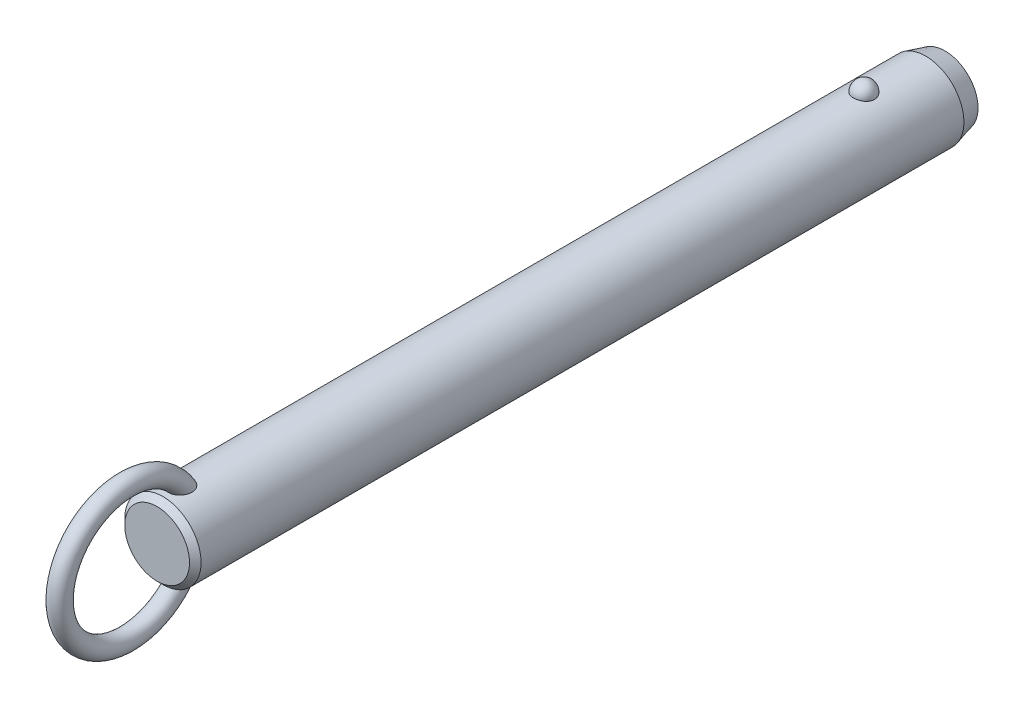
ISO-10303-21;
HEADER;
FILE_DESCRIPTION(('STEP AP214'),'2;1');
FILE_NAME('part.step','',(''),(''),'','','');
FILE_SCHEMA(('AUTOMOTIVE_DESIGN { 1 0 10303 214 1 1 1 1 }'));
ENDSEC;
DATA;
#1=APPLICATION_CONTEXT('core data for automotive mechanical design processes');
#2=APPLICATION_PROTOCOL_DEFINITION('international standard','automotive_design',2000,#1);
#3=PRODUCT_CONTEXT('',#1,'mechanical');
#4=PRODUCT('Part','Part','',(#3));
#5=PRODUCT_RELATED_PRODUCT_CATEGORY('part','',(#4));
#6=PRODUCT_DEFINITION_FORMATION('','',#4);
#7=PRODUCT_DEFINITION_CONTEXT('part definition',#1,'design');
#8=PRODUCT_DEFINITION('design','',#6,#7);
#9=PRODUCT_DEFINITION_SHAPE('','',#8);
#10=(LENGTH_UNIT() NAMED_UNIT(*) SI_UNIT(.MILLI.,.METRE.));
#11=(NAMED_UNIT(*) PLANE_ANGLE_UNIT() SI_UNIT($,.RADIAN.));
#12=(NAMED_UNIT(*) SI_UNIT($,.STERADIAN.) SOLID_ANGLE_UNIT());
#13=UNCERTAINTY_MEASURE_WITH_UNIT(LENGTH_MEASURE(1.E-05),#10,'distance_accuracy_value','');
#14=(GEOMETRIC_REPRESENTATION_CONTEXT(3) GLOBAL_UNCERTAINTY_ASSIGNED_CONTEXT((#13)) GLOBAL_UNIT_ASSIGNED_CONTEXT((#10,
#11,#12)) REPRESENTATION_CONTEXT('',''));
#15=CARTESIAN_POINT('',(0.,0.,0.));
#16=DIRECTION('',(0.,0.,1.));
#17=DIRECTION('',(1.,0.,0.));
#18=AXIS2_PLACEMENT_3D('',#15,#16,#17);
#19=CARTESIAN_POINT('',(0.,0.,134.6));
#20=DIRECTION('',(0.,0.,-1.));
#21=DIRECTION('',(-1.,0.,0.));
#22=AXIS2_PLACEMENT_3D('',#19,#20,#21);
#23=CYLINDRICAL_SURFACE('',#22,7.9);
#24=CARTESIAN_POINT('',(2.1785689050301,7.59367088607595,-2.19999999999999));
#25=CARTESIAN_POINT('',(2.17856679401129,7.59367269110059,-2.07701843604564));
#26=CARTESIAN_POINT('',(2.16853481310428,7.59657145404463,-1.95401006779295));
#27=CARTESIAN_POINT('',(2.12864689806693,7.607843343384,-1.71147811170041));
#28=CARTESIAN_POINT('',(2.09878338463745,7.61621856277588,-1.59195587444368));
#29=CARTESIAN_POINT('',(2.0199931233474,7.63749180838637,-1.3598563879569));
#30=CARTESIAN_POINT('',(1.97107475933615,7.6503878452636,-1.24727610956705));
#31=CARTESIAN_POINT('',(1.85539377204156,7.67926115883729,-1.03213234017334));
#32=CARTESIAN_POINT('',(1.78863158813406,7.69523835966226,-0.929568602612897));
#33=CARTESIAN_POINT('',(1.63856494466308,7.7285848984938,-0.736786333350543));
#34=CARTESIAN_POINT('',(1.55518140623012,7.7459606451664,-0.646630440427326));
#35=CARTESIAN_POINT('',(1.37422937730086,7.78009978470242,-0.481747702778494));
#36=CARTESIAN_POINT('',(1.27666086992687,7.79686317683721,-0.407020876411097));
#37=CARTESIAN_POINT('',(1.07024728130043,7.82786153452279,-0.275278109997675));
#38=CARTESIAN_POINT('',(0.961434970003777,7.84210353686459,-0.218212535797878));
#39=CARTESIAN_POINT('',(0.735351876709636,7.86652194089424,-0.123146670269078));
#40=CARTESIAN_POINT('',(0.618082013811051,7.87669878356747,-0.085144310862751));
#41=CARTESIAN_POINT('',(0.380637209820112,7.89170521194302,-0.0298158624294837));
#42=CARTESIAN_POINT('',(0.260550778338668,7.89662650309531,-0.0121347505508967));
#43=CARTESIAN_POINT('',(0.0190117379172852,7.90090003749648,0.00324379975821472));
#44=CARTESIAN_POINT('',(-0.102440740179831,7.90025280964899,0.00094313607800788));
#45=CARTESIAN_POINT('',(-0.341452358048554,7.89351056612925,-0.0233955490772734));
#46=CARTESIAN_POINT('',(-0.459042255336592,7.88749257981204,-0.0451545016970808));
#47=CARTESIAN_POINT('',(-0.688796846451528,7.87075812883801,-0.107408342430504));
#48=CARTESIAN_POINT('',(-0.800961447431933,7.86004158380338,-0.147903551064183));
#49=CARTESIAN_POINT('',(-1.01743634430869,7.83497131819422,-0.246799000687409));
#50=CARTESIAN_POINT('',(-1.12169791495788,7.82059709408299,-0.305300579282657));
#51=CARTESIAN_POINT('',(-1.31891765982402,7.78976470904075,-0.438549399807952));
#52=CARTESIAN_POINT('',(-1.41187469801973,7.77330633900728,-0.513298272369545));
#53=CARTESIAN_POINT('',(-1.58577142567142,7.73972434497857,-0.678622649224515));
#54=CARTESIAN_POINT('',(-1.66645140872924,7.72259402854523,-0.769470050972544));
#55=CARTESIAN_POINT('',(-1.81161503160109,7.68983776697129,-0.963538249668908));
#56=CARTESIAN_POINT('',(-1.87609753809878,7.6742119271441,-1.06675991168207));
#57=CARTESIAN_POINT('',(-1.98790138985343,7.6460202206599,-1.28401170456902));
#58=CARTESIAN_POINT('',(-2.03501994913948,7.63349104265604,-1.39815107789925));
#59=CARTESIAN_POINT('',(-2.10986724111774,7.6131449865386,-1.63301784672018));
#60=CARTESIAN_POINT('',(-2.1375965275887,7.60532797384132,-1.75374505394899));
#61=CARTESIAN_POINT('',(-2.17289256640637,7.5953195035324,-1.99782562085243));
#62=CARTESIAN_POINT('',(-2.18054294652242,7.59310471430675,-2.12116592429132));
#63=CARTESIAN_POINT('',(-2.17572919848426,7.59448538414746,-2.36741799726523));
#64=CARTESIAN_POINT('',(-2.1632656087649,7.59808068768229,-2.49032977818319));
#65=CARTESIAN_POINT('',(-2.11865035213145,7.61064035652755,-2.73161015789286));
#66=CARTESIAN_POINT('',(-2.08659579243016,7.61957823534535,-2.84999812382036));
#67=CARTESIAN_POINT('',(-2.00367799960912,7.64179982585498,-3.07955956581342));
#68=CARTESIAN_POINT('',(-1.9528140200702,7.65508371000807,-3.19073275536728));
#69=CARTESIAN_POINT('',(-1.83321113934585,7.68460381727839,-3.40337899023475));
#70=CARTESIAN_POINT('',(-1.76437735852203,7.70085556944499,-3.50479651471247));
#71=CARTESIAN_POINT('',(-1.61069526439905,7.73445734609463,-3.69446912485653));
#72=CARTESIAN_POINT('',(-1.52584634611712,7.75180741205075,-3.78272371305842));
#73=CARTESIAN_POINT('',(-1.34198059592,7.78574608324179,-3.94393987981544));
#74=CARTESIAN_POINT('',(-1.24291308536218,7.80233167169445,-4.01684434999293));
#75=CARTESIAN_POINT('',(-1.03352039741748,7.83281625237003,-4.14489386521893));
#76=CARTESIAN_POINT('',(-0.92319600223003,7.84671543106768,-4.20004014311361));
#77=CARTESIAN_POINT('',(-0.695822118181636,7.87011575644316,-4.29042017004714));
#78=CARTESIAN_POINT('',(-0.578872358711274,7.87966903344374,-4.32589112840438));
#79=CARTESIAN_POINT('',(-0.340410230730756,7.8935652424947,-4.37692226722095));
#80=CARTESIAN_POINT('',(-0.218898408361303,7.89790879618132,-4.39248482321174));
#81=CARTESIAN_POINT('',(0.0228107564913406,7.90087453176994,-4.40314405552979));
#82=CARTESIAN_POINT('',(0.142990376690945,7.89960185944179,-4.39861683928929));
#83=CARTESIAN_POINT('',(0.380829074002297,7.89171262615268,-4.37008293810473));
#84=CARTESIAN_POINT('',(0.498488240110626,7.8850962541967,-4.34607694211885));
#85=CARTESIAN_POINT('',(0.727535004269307,7.86726442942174,-4.27939317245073));
#86=CARTESIAN_POINT('',(0.838944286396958,7.85606616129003,-4.236785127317));
#87=CARTESIAN_POINT('',(1.05295421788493,7.83025654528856,-4.13408348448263));
#88=CARTESIAN_POINT('',(1.15555431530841,7.81564498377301,-4.07398879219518));
#89=CARTESIAN_POINT('',(1.35076763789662,7.7843022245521,-3.93687432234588));
#90=CARTESIAN_POINT('',(1.4432046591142,7.76754209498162,-3.85961036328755));
#91=CARTESIAN_POINT('',(1.6139111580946,7.73387857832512,-3.69076949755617));
#92=CARTESIAN_POINT('',(1.6921781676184,7.71697516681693,-3.59919010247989));
#93=CARTESIAN_POINT('',(1.83380875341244,7.6845643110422,-3.40247278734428));
#94=CARTESIAN_POINT('',(1.89689280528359,7.66908588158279,-3.29712873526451));
#95=CARTESIAN_POINT('',(2.0047823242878,7.64159441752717,-3.07707931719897));
#96=CARTESIAN_POINT('',(2.0495945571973,7.62958010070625,-2.96237743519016));
#97=CARTESIAN_POINT('',(2.11580183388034,7.61146617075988,-2.74040519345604));
#98=CARTESIAN_POINT('',(2.13929812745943,7.60484503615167,-2.63379846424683));
#99=CARTESIAN_POINT('',(2.17068242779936,7.59594664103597,-2.41813481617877));
#100=CARTESIAN_POINT('',(2.17857077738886,7.59366928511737,-2.30907795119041));
#101=CARTESIAN_POINT('',(2.1785689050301,7.59367088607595,-2.19999999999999));
#102=B_SPLINE_CURVE_WITH_KNOTS('',3,(#24,#25,#26,#27,#28,#29,#30,#31,#32,#33,#34,#35,#36,#37,
#38,#39,#40,#41,#42,#43,#44,#45,#46,#47,#48,#49,#50,#51,#52,#53,#54,#55,#56,#57,#58,#59,#60,#61,
#62,#63,#64,#65,#66,#67,#68,#69,#70,#71,#72,#73,#74,#75,#76,#77,#78,#79,#80,#81,#82,#83,#84,#85,
#86,#87,#88,#89,#90,#91,#92,#93,#94,#95,#96,#97,#98,#99,#100,#101),.UNSPECIFIED.,.T.,.F.,(4,2,2,
2,2,2,2,2,2,2,2,2,2,2,2,2,2,2,2,2,2,2,2,2,2,2,2,2,2,2,2,2,2,2,2,2,2,2,4),(0.,0.368552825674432,
0.737246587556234,1.10577831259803,1.4743009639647,1.8446206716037,2.21494081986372,
2.5842105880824,2.95344028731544,3.31611630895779,3.67875788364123,4.03628044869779,
4.39380913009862,4.75338791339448,5.11300280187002,5.47939989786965,5.8458226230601,
6.21639834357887,6.58696347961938,6.95598276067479,7.32499216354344,7.69218715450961,
8.0593967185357,8.42858578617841,8.79778880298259,9.16834203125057,9.5388695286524,
9.90482699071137,10.2707407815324,10.6298333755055,10.9889132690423,11.3466585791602,
11.7044262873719,12.0676511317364,12.4309391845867,12.8004764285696,13.1698767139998,
13.4967701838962,13.8236564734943),.UNSPECIFIED.);
#103=CARTESIAN_POINT('',(2.1785689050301,7.59367088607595,-2.19999999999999));
#104=VERTEX_POINT('',#103);
#105=EDGE_CURVE('E41',#104,#104,#102,.T.);
#106=ORIENTED_EDGE('',*,*,#105,.T.);
#107=EDGE_LOOP('',(#106));
#108=FACE_BOUND('',#107,.T.);
#109=CARTESIAN_POINT('',(0.,0.,142.92));
#110=DIRECTION('',(0.,0.,1.));
#111=DIRECTION('',(1.,0.,0.));
#112=AXIS2_PLACEMENT_3D('',#109,#110,#111);
#113=CIRCLE('',#112,7.9);
#114=CARTESIAN_POINT('',(7.9,0.,142.92));
#115=VERTEX_POINT('',#114);
#116=EDGE_CURVE('E10',#115,#115,#113,.F.);
#117=ORIENTED_EDGE('',*,*,#116,.T.);
#118=EDGE_LOOP('',(#117));
#119=FACE_BOUND('',#118,.T.);
#120=CARTESIAN_POINT('',(-0.630969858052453,-7.87476203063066,136.812432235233));
#121=CARTESIAN_POINT('',(-0.734180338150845,-7.86648998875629,136.847285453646));
#122=CARTESIAN_POINT('',(-0.83447695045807,-7.85639291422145,136.890816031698));
#123=CARTESIAN_POINT('',(-1.0262035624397,-7.83366343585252,136.994094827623));
#124=CARTESIAN_POINT('',(-1.1176141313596,-7.82102565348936,137.053877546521));
#125=CARTESIAN_POINT('',(-1.28877277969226,-7.79464922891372,137.187839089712));
#126=CARTESIAN_POINT('',(-1.36854014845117,-7.78091246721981,137.261993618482));
#127=CARTESIAN_POINT('',(-1.51461521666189,-7.75380398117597,137.422494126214));
#128=CARTESIAN_POINT('',(-1.58092966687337,-7.74043207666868,137.508833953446));
#129=CARTESIAN_POINT('',(-1.70019064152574,-7.7151252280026,137.692978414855));
#130=CARTESIAN_POINT('',(-1.75284037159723,-7.70322473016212,137.790979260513));
#131=CARTESIAN_POINT('',(-1.84263464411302,-7.68224112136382,137.994102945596));
#132=CARTESIAN_POINT('',(-1.87977299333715,-7.6731591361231,138.099228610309));
#133=CARTESIAN_POINT('',(-1.94152728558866,-7.65777930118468,138.323284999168));
#134=CARTESIAN_POINT('',(-1.96475471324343,-7.65179654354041,138.442616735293));
#135=CARTESIAN_POINT('',(-1.99449499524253,-7.64409642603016,138.68342986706));
#136=CARTESIAN_POINT('',(-2.0010005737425,-7.64238092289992,138.804912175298));
#137=CARTESIAN_POINT('',(-1.99856014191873,-7.64302120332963,139.068340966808));
#138=CARTESIAN_POINT('',(-1.98680021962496,-7.64611845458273,139.21025654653));
#139=CARTESIAN_POINT('',(-1.94457772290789,-7.65696186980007,139.491118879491));
#140=CARTESIAN_POINT('',(-1.91409393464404,-7.66471330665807,139.630062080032));
#141=CARTESIAN_POINT('',(-1.82768670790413,-7.68582947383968,139.931939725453));
#142=CARTESIAN_POINT('',(-1.76772963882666,-7.70003779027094,140.093686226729));
#143=CARTESIAN_POINT('',(-1.65998501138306,-7.72371550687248,140.327695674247));
#144=CARTESIAN_POINT('',(-1.62107967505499,-7.73200670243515,140.404297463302));
#145=CARTESIAN_POINT('',(-1.53727726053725,-7.7491037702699,140.554079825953));
#146=CARTESIAN_POINT('',(-1.49238215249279,-7.75790947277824,140.627261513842));
#147=CARTESIAN_POINT('',(-1.37397050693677,-7.77993338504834,140.80288382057));
#148=CARTESIAN_POINT('',(-1.29690364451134,-7.79328473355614,140.902955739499));
#149=CARTESIAN_POINT('',(-1.12885487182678,-7.81939266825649,141.090714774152));
#150=CARTESIAN_POINT('',(-1.03789926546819,-7.83215032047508,141.178424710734));
#151=CARTESIAN_POINT('',(-0.869532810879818,-7.85231710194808,141.313414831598));
#152=CARTESIAN_POINT('',(-0.795716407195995,-7.86021093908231,141.365076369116));
#153=CARTESIAN_POINT('',(-0.640813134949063,-7.87434920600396,141.456381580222));
#154=CARTESIAN_POINT('',(-0.559737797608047,-7.88059619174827,141.49604389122));
#155=CARTESIAN_POINT('',(-0.406456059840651,-7.88984116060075,141.554300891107));
#156=CARTESIAN_POINT('',(-0.335227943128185,-7.89321892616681,141.575384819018));
#157=CARTESIAN_POINT('',(-0.190193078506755,-7.89804235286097,141.60541418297));
#158=CARTESIAN_POINT('',(-0.116388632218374,-7.89948969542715,141.614370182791));
#159=CARTESIAN_POINT('',(0.0318414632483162,-7.90028409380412,141.619291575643));
#160=CARTESIAN_POINT('',(0.106268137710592,-7.89962640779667,141.615227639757));
#161=CARTESIAN_POINT('',(0.253290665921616,-7.8962818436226,141.594461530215));
#162=CARTESIAN_POINT('',(0.325885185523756,-7.8935935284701,141.577750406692));
#163=CARTESIAN_POINT('',(0.481441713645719,-7.88577340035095,141.528738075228));
#164=CARTESIAN_POINT('',(0.563611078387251,-7.88026321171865,141.494005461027));
#165=CARTESIAN_POINT('',(0.721129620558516,-7.86741729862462,141.411796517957));
#166=CARTESIAN_POINT('',(0.79646633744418,-7.86007832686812,141.364297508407));
#167=CARTESIAN_POINT('',(0.971456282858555,-7.84073285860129,141.236513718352));
#168=CARTESIAN_POINT('',(1.06719686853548,-7.82809461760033,141.151004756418));
#169=CARTESIAN_POINT('',(1.24418921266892,-7.80192439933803,140.966232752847));
#170=CARTESIAN_POINT('',(1.32540832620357,-7.78839049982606,140.866939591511));
#171=CARTESIAN_POINT('',(1.45199971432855,-7.76559693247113,140.689576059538));
#172=CARTESIAN_POINT('',(1.50085649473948,-7.75626094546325,140.613954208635));
#173=CARTESIAN_POINT('',(1.59197749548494,-7.73807279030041,140.458742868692));
#174=CARTESIAN_POINT('',(1.63423919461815,-7.72922080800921,140.379151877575));
#175=CARTESIAN_POINT('',(1.71222612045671,-7.71231959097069,140.216664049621));
#176=CARTESIAN_POINT('',(1.74794516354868,-7.70427111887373,140.133764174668));
#177=CARTESIAN_POINT('',(1.81270113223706,-7.68929240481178,139.965296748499));
#178=CARTESIAN_POINT('',(1.84173789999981,-7.68236218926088,139.879729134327));
#179=CARTESIAN_POINT('',(1.89322698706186,-7.6698375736,139.70528702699));
#180=CARTESIAN_POINT('',(1.91558744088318,-7.66426199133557,139.616383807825));
#181=CARTESIAN_POINT('',(1.95281367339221,-7.65485915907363,139.436969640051));
#182=CARTESIAN_POINT('',(1.96767946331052,-7.65103190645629,139.346458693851));
#183=CARTESIAN_POINT('',(2.0002145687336,-7.64262981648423,139.073732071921));
#184=CARTESIAN_POINT('',(2.00600691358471,-7.6410871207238,138.889709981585));
#185=CARTESIAN_POINT('',(1.98445334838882,-7.64669564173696,138.576501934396));
#186=CARTESIAN_POINT('',(1.96607186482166,-7.65149688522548,138.446618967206));
#187=CARTESIAN_POINT('',(1.90884967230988,-7.66597624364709,138.191632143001));
#188=CARTESIAN_POINT('',(1.87002101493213,-7.67565148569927,138.066525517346));
#189=CARTESIAN_POINT('',(1.77063986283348,-7.69918471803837,137.82454013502));
#190=CARTESIAN_POINT('',(1.70993724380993,-7.71307150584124,137.707725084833));
#191=CARTESIAN_POINT('',(1.56733070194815,-7.74330306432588,137.488144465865));
#192=CARTESIAN_POINT('',(1.48543692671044,-7.75964665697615,137.385372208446));
#193=CARTESIAN_POINT('',(1.31346177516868,-7.79047523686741,137.209380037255));
#194=CARTESIAN_POINT('',(1.22547278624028,-7.80495298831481,137.134106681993));
#195=CARTESIAN_POINT('',(1.03724352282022,-7.83218597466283,137.000486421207));
#196=CARTESIAN_POINT('',(0.93700840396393,-7.84494192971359,136.942132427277));
#197=CARTESIAN_POINT('',(0.733599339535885,-7.86649045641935,136.847027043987));
#198=CARTESIAN_POINT('',(0.630941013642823,-7.87547134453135,136.809210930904));
#199=CARTESIAN_POINT('',(0.420465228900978,-7.88950708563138,136.751116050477));
#200=CARTESIAN_POINT('',(0.312645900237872,-7.89456050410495,136.73084369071));
#201=CARTESIAN_POINT('',(0.096086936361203,-7.9001518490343,136.708455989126));
#202=CARTESIAN_POINT('',(-0.0126341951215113,-7.90073226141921,136.706169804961));
#203=CARTESIAN_POINT('',(-0.228766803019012,-7.89742350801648,136.719367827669));
#204=CARTESIAN_POINT('',(-0.336180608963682,-7.89354403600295,136.734813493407));
#205=CARTESIAN_POINT('',(-0.473410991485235,-7.88586871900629,136.766217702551));
#206=CARTESIAN_POINT('',(-0.50525779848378,-7.88388984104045,136.774354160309));
#207=CARTESIAN_POINT('',(-0.56848128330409,-7.87958326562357,136.792208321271));
#208=CARTESIAN_POINT('',(-0.59985795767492,-7.87725556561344,136.801926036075));
#209=CARTESIAN_POINT('',(-0.630969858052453,-7.87476203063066,136.812432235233));
#210=B_SPLINE_CURVE_WITH_KNOTS('',3,(#120,#121,#122,#123,#124,#125,#126,#127,#128,#129,#130,
#131,#132,#133,#134,#135,#136,#137,#138,#139,#140,#141,#142,#143,#144,#145,#146,#147,#148,#149,
#150,#151,#152,#153,#154,#155,#156,#157,#158,#159,#160,#161,#162,#163,#164,#165,#166,#167,#168,
#169,#170,#171,#172,#173,#174,#175,#176,#177,#178,#179,#180,#181,#182,#183,#184,#185,#186,#187,
#188,#189,#190,#191,#192,#193,#194,#195,#196,#197,#198,#199,#200,#201,#202,#203,#204,#205,#206,
#207,#208,#209),.UNSPECIFIED.,.T.,.F.,(4,2,2,2,2,2,2,2,2,2,2,2,2,2,2,2,2,2,2,2,2,2,2,2,2,2,2,2,
2,2,2,2,2,2,2,2,2,2,2,2,2,2,2,2,4),(0.,0.327622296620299,0.655945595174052,0.983718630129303,
1.3113267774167,1.64554655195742,1.97989964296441,2.34365728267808,2.70757317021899,
3.13333684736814,3.5595838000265,4.07655306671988,4.33527897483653,4.59391999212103,
4.97382437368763,5.353017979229,5.62348245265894,5.89352465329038,6.11565959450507,
6.33760092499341,6.56004255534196,6.78264174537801,7.04930844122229,7.31645206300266,
7.70130871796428,8.08701995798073,8.35824509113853,8.6295736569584,8.9011573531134,
9.1727474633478,9.44791855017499,9.72308922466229,10.2715298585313,10.6638393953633,
11.0559179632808,11.4507403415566,11.8453740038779,12.1936425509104,12.5417649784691,
12.8695063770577,13.1973674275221,13.5221104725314,13.8461490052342,13.9449071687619,
14.0436660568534),.UNSPECIFIED.);
#211=CARTESIAN_POINT('',(-0.630969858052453,-7.87476203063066,136.812432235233));
#212=VERTEX_POINT('',#211);
#213=EDGE_CURVE('E59',#212,#212,#210,.T.);
#214=ORIENTED_EDGE('',*,*,#213,.T.);
#215=EDGE_LOOP('',(#214));
#216=FACE_BOUND('',#215,.T.);
#217=CARTESIAN_POINT('',(-0.630969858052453,7.87476203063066,136.812432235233));
#218=CARTESIAN_POINT('',(-0.528918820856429,7.88293636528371,136.777979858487));
#219=CARTESIAN_POINT('',(-0.423745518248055,7.88934810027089,136.751915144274));
#220=CARTESIAN_POINT('',(-0.210236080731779,7.8979273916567,136.717282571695));
#221=CARTESIAN_POINT('',(-0.10189380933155,7.90008607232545,136.708751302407));
#222=CARTESIAN_POINT('',(0.114660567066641,7.89990877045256,136.709457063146));
#223=CARTESIAN_POINT('',(0.222872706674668,7.89757640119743,136.71867980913));
#224=CARTESIAN_POINT('',(0.436107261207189,7.88867538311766,136.754652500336));
#225=CARTESIAN_POINT('',(0.541131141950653,7.8821087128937,136.78139425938));
#226=CARTESIAN_POINT('',(0.745085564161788,7.86545130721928,136.851756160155));
#227=CARTESIAN_POINT('',(0.844015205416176,7.85536005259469,136.895378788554));
#228=CARTESIAN_POINT('',(1.03299167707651,7.83275153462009,136.998379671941));
#229=CARTESIAN_POINT('',(1.12303841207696,7.8202342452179,137.057758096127));
#230=CARTESIAN_POINT('',(1.29214734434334,7.79408219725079,137.190864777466));
#231=CARTESIAN_POINT('',(1.37116907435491,7.78044359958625,137.264643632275));
#232=CARTESIAN_POINT('',(1.51597677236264,7.75353170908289,137.424235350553));
#233=CARTESIAN_POINT('',(1.58176261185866,7.74025841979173,137.510048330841));
#234=CARTESIAN_POINT('',(1.70057386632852,7.71504069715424,137.693644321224));
#235=CARTESIAN_POINT('',(1.75320073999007,7.7031425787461,137.791690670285));
#236=CARTESIAN_POINT('',(1.8429376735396,7.68216822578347,137.994893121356));
#237=CARTESIAN_POINT('',(1.88004278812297,7.67309289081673,138.100051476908));
#238=CARTESIAN_POINT('',(1.9417232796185,7.6577294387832,138.324167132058));
#239=CARTESIAN_POINT('',(1.96491037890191,7.65175648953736,138.443524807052));
#240=CARTESIAN_POINT('',(1.9945689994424,7.64407702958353,138.684384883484));
#241=CARTESIAN_POINT('',(2.00103304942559,7.64237242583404,138.80588821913));
#242=CARTESIAN_POINT('',(1.99850166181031,7.64303650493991,139.069368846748));
#243=CARTESIAN_POINT('',(1.98669038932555,7.64614714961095,139.211314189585));
#244=CARTESIAN_POINT('',(1.94436120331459,7.6570170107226,139.492228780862));
#245=CARTESIAN_POINT('',(1.91382203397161,7.66478150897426,139.631194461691));
#246=CARTESIAN_POINT('',(1.82728754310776,7.68592483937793,139.933111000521));
#247=CARTESIAN_POINT('',(1.76725778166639,7.7001468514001,140.094872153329));
#248=CARTESIAN_POINT('',(1.65939700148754,7.72384204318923,140.328891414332));
#249=CARTESIAN_POINT('',(1.62045187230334,7.73213852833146,140.405494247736));
#250=CARTESIAN_POINT('',(1.53656684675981,7.74924489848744,140.555273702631));
#251=CARTESIAN_POINT('',(1.49162892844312,7.75805461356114,140.628451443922));
#252=CARTESIAN_POINT('',(1.37317698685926,7.78007342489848,140.803952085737));
#253=CARTESIAN_POINT('',(1.29612360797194,7.79341423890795,140.903911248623));
#254=CARTESIAN_POINT('',(1.12812043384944,7.81949839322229,141.09145083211));
#255=CARTESIAN_POINT('',(1.03719688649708,7.83224280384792,141.179054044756));
#256=CARTESIAN_POINT('',(0.868871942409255,7.85239026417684,141.31389715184));
#257=CARTESIAN_POINT('',(0.795056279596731,7.86027769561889,141.365511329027));
#258=CARTESIAN_POINT('',(0.640160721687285,7.87440222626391,141.456720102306));
#259=CARTESIAN_POINT('',(0.559092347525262,7.88064188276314,141.496333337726));
#260=CARTESIAN_POINT('',(0.405820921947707,7.8898738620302,141.554505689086));
#261=CARTESIAN_POINT('',(0.334594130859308,7.89324577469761,141.575552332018));
#262=CARTESIAN_POINT('',(0.189568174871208,7.89805733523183,141.605507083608));
#263=CARTESIAN_POINT('',(0.115771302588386,7.89949866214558,141.614425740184));
#264=CARTESIAN_POINT('',(-0.0324359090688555,7.90028156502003,141.61927589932));
#265=CARTESIAN_POINT('',(-0.106847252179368,7.89961843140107,141.615178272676));
#266=CARTESIAN_POINT('',(-0.253834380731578,7.8962642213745,141.594351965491));
#267=CARTESIAN_POINT('',(-0.326408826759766,7.89357170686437,141.577614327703));
#268=CARTESIAN_POINT('',(-0.481962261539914,7.88574179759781,141.528539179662));
#269=CARTESIAN_POINT('',(-0.564145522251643,7.88022507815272,141.493763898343));
#270=CARTESIAN_POINT('',(-0.721685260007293,7.86736646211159,141.411468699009));
#271=CARTESIAN_POINT('',(-0.797029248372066,7.8600213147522,141.363926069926));
#272=CARTESIAN_POINT('',(-0.9720442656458,7.84066026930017,141.236026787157));
#273=CARTESIAN_POINT('',(-1.06779803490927,7.82801274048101,141.150443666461));
#274=CARTESIAN_POINT('',(-1.2448053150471,7.80182621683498,140.965522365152));
#275=CARTESIAN_POINT('',(-1.32602618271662,7.78828530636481,140.866154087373));
#276=CARTESIAN_POINT('',(-1.45259834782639,7.76548487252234,140.688680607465));
#277=CARTESIAN_POINT('',(-1.50143856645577,7.75614818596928,140.613025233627));
#278=CARTESIAN_POINT('',(-1.59252410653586,7.73796020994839,140.457748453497));
#279=CARTESIAN_POINT('',(-1.63476690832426,7.72910910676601,140.378125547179));
#280=CARTESIAN_POINT('',(-1.71271318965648,7.71221133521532,140.215575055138));
#281=CARTESIAN_POINT('',(-1.74841047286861,7.70416543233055,140.132644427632));
#282=CARTESIAN_POINT('',(-1.81311929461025,7.6891937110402,139.964116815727));
#283=CARTESIAN_POINT('',(-1.84213067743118,7.68226791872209,139.878519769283));
#284=CARTESIAN_POINT('',(-1.89356259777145,7.66975461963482,139.704025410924));
#285=CARTESIAN_POINT('',(-1.91589165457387,7.66418586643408,139.615099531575));
#286=CARTESIAN_POINT('',(-1.9530507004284,7.65479859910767,139.435642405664));
#287=CARTESIAN_POINT('',(-1.96788069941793,7.65098008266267,139.345111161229));
#288=CARTESIAN_POINT('',(-2.00030078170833,7.64260704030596,139.072327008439));
#289=CARTESIAN_POINT('',(-2.00600576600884,7.64108760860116,138.888271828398));
#290=CARTESIAN_POINT('',(-1.9842848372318,7.64673945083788,138.575080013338));
#291=CARTESIAN_POINT('',(-1.96583698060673,7.65155751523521,138.445240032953));
#292=CARTESIAN_POINT('',(-1.90848948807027,7.66606613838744,138.190361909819));
#293=CARTESIAN_POINT('',(-1.86960376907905,7.67575338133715,138.065320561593));
#294=CARTESIAN_POINT('',(-1.77013421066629,7.6993013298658,137.823500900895));
#295=CARTESIAN_POINT('',(-1.70940488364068,7.71318991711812,137.706784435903));
#296=CARTESIAN_POINT('',(-1.56672953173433,7.74342495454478,137.487340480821));
#297=CARTESIAN_POINT('',(-1.48478316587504,7.75977144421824,137.38461321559));
#298=CARTESIAN_POINT('',(-1.31266325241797,7.79061163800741,137.208643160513));
#299=CARTESIAN_POINT('',(-1.22456383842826,7.80509908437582,137.133358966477));
#300=CARTESIAN_POINT('',(-1.03622400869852,7.83231881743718,136.999865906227));
#301=CARTESIAN_POINT('',(-0.936015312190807,7.84505551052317,136.941613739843));
#302=CARTESIAN_POINT('',(-0.798824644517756,7.85957802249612,136.877540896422));
#303=CARTESIAN_POINT('',(-0.765787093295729,7.86286821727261,136.863224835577));
#304=CARTESIAN_POINT('',(-0.698939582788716,7.86909211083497,136.836436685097));
#305=CARTESIAN_POINT('',(-0.66512963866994,7.8720258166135,136.823964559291));
#306=CARTESIAN_POINT('',(-0.630969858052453,7.87476203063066,136.812432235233));
#307=B_SPLINE_CURVE_WITH_KNOTS('',3,(#217,#218,#219,#220,#221,#222,#223,#224,#225,#226,#227,
#228,#229,#230,#231,#232,#233,#234,#235,#236,#237,#238,#239,#240,#241,#242,#243,#244,#245,#246,
#247,#248,#249,#250,#251,#252,#253,#254,#255,#256,#257,#258,#259,#260,#261,#262,#263,#264,#265,
#266,#267,#268,#269,#270,#271,#272,#273,#274,#275,#276,#277,#278,#279,#280,#281,#282,#283,#284,
#285,#286,#287,#288,#289,#290,#291,#292,#293,#294,#295,#296,#297,#298,#299,#300,#301,#302,#303,
#304,#305,#306),.UNSPECIFIED.,.T.,.F.,(4,2,2,2,2,2,2,2,2,2,2,2,2,2,2,2,2,2,2,2,2,2,2,2,2,2,2,2,
2,2,2,2,2,2,2,2,2,2,2,2,2,2,2,2,4),(0.,0.323920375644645,0.648516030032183,0.972850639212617,
1.29703380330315,1.62126473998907,1.94549915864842,2.27089401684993,2.5962920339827,
2.93059633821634,3.26500707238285,3.6288164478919,3.99278833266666,4.4186542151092,
4.84500434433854,5.36209210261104,5.62087589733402,5.87957448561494,6.25918598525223,
6.63808782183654,6.90846748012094,7.17842501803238,7.40052350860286,7.6224287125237,
7.84483086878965,8.0673907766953,8.33414615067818,8.60137921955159,8.98641454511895,
9.37230415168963,9.64358673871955,9.91497268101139,10.1866142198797,10.4582620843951,
10.7334745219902,11.008686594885,11.5572126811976,11.9494246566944,12.3413699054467,
12.7359755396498,13.1305875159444,13.4791770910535,13.82687259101,13.9353013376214,
14.0437279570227),.UNSPECIFIED.);
#308=CARTESIAN_POINT('',(-0.630969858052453,7.87476203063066,136.812432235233));
#309=VERTEX_POINT('',#308);
#310=EDGE_CURVE('E67',#309,#309,#307,.T.);
#311=ORIENTED_EDGE('',*,*,#310,.T.);
#312=EDGE_LOOP('',(#311));
#313=FACE_BOUND('',#312,.T.);
#314=CARTESIAN_POINT('',(0.,0.,-15.));
#315=DIRECTION('',(0.,0.,-1.));
#316=DIRECTION('',(-1.,0.,0.));
#317=AXIS2_PLACEMENT_3D('',#314,#315,#316);
#318=CIRCLE('',#317,7.9);
#319=CARTESIAN_POINT('',(-7.9,0.,-15.));
#320=VERTEX_POINT('',#319);
#321=EDGE_CURVE('E56',#320,#320,#318,.F.);
#322=ORIENTED_EDGE('',*,*,#321,.T.);
#323=EDGE_LOOP('',(#322));
#324=FACE_BOUND('',#323,.T.);
#325=ADVANCED_FACE('F37',(#108,#119,#216,#313,#324),#23,.T.);
#326=CARTESIAN_POINT('',(0.,0.,-19.));
#327=DIRECTION('',(0.,0.,-1.));
#328=DIRECTION('',(-1.,0.,0.));
#329=AXIS2_PLACEMENT_3D('',#326,#327,#328);
#330=PLANE('',#329);
#331=CARTESIAN_POINT('',(0.,0.,-19.));
#332=DIRECTION('',(0.,0.,-1.));
#333=DIRECTION('',(-1.,0.,0.));
#334=AXIS2_PLACEMENT_3D('',#331,#332,#333);
#335=CIRCLE('',#334,6.82820323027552);
#336=CARTESIAN_POINT('',(-6.82820323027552,0.,-19.));
#337=VERTEX_POINT('',#336);
#338=EDGE_CURVE('E66',#337,#337,#335,.T.);
#339=ORIENTED_EDGE('',*,*,#338,.T.);
#340=EDGE_LOOP('',(#339));
#341=FACE_BOUND('',#340,.T.);
#342=ADVANCED_FACE('F85',(#341),#330,.T.);
#343=CARTESIAN_POINT('',(0.,0.,-19.));
#344=DIRECTION('',(0.,0.,1.));
#345=DIRECTION('',(1.,0.,0.));
#346=AXIS2_PLACEMENT_3D('',#343,#344,#345);
#347=CONICAL_SURFACE('',#346,6.82820323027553,0.261799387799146);
#348=ORIENTED_EDGE('',*,*,#321,.F.);
#349=EDGE_LOOP('',(#348));
#350=FACE_BOUND('',#349,.T.);
#351=ORIENTED_EDGE('',*,*,#338,.F.);
#352=EDGE_LOOP('',(#351));
#353=FACE_BOUND('',#352,.T.);
#354=ADVANCED_FACE('F83',(#350,#353),#347,.T.);
#355=CARTESIAN_POINT('',(0.,0.,144.12));
#356=DIRECTION('',(0.,0.,1.));
#357=DIRECTION('',(1.,0.,0.));
#358=AXIS2_PLACEMENT_3D('',#355,#356,#357);
#359=PLANE('',#358);
#360=CARTESIAN_POINT('',(0.,0.,144.12));
#361=DIRECTION('',(0.,0.,1.));
#362=DIRECTION('',(1.,0.,0.));
#363=AXIS2_PLACEMENT_3D('',#360,#361,#362);
#364=CIRCLE('',#363,6.70000000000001);
#365=CARTESIAN_POINT('',(6.70000000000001,0.,144.12));
#366=VERTEX_POINT('',#365);
#367=EDGE_CURVE('E50',#366,#366,#364,.T.);
#368=ORIENTED_EDGE('',*,*,#367,.T.);
#369=EDGE_LOOP('',(#368));
#370=FACE_BOUND('',#369,.T.);
#371=ADVANCED_FACE('F77',(#370),#359,.T.);
#372=CARTESIAN_POINT('',(0.,0.,150.45));
#373=DIRECTION('',(1.,0.,0.));
#374=DIRECTION('',(0.,0.,-1.));
#375=AXIS2_PLACEMENT_3D('',#372,#373,#374);
#376=TOROIDAL_SURFACE('',#375,13.85,2.);
#377=ORIENTED_EDGE('',*,*,#310,.F.);
#378=EDGE_LOOP('',(#377));
#379=FACE_BOUND('',#378,.T.);
#380=ORIENTED_EDGE('',*,*,#213,.F.);
#381=EDGE_LOOP('',(#380));
#382=FACE_BOUND('',#381,.T.);
#383=ADVANCED_FACE('F73',(#379,#382),#376,.T.);
#384=CARTESIAN_POINT('',(0.,0.,144.12));
#385=DIRECTION('',(0.,0.,-1.));
#386=DIRECTION('',(-1.,0.,0.));
#387=AXIS2_PLACEMENT_3D('',#384,#385,#386);
#388=CONICAL_SURFACE('',#387,6.70000000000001,0.785398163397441);
#389=ORIENTED_EDGE('',*,*,#116,.F.);
#390=EDGE_LOOP('',(#389));
#391=FACE_BOUND('',#390,.T.);
#392=ORIENTED_EDGE('',*,*,#367,.F.);
#393=EDGE_LOOP('',(#392));
#394=FACE_BOUND('',#393,.T.);
#395=ADVANCED_FACE('F39',(#391,#394),#388,.T.);
#396=CARTESIAN_POINT('',(0.,7.9,-2.19999999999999));
#397=DIRECTION('',(0.,1.,0.));
#398=DIRECTION('',(0.,0.,1.));
#399=AXIS2_PLACEMENT_3D('',#396,#397,#398);
#400=SPHERICAL_SURFACE('',#399,2.2);
#401=ORIENTED_EDGE('',*,*,#105,.F.);
#402=EDGE_LOOP('',(#401));
#403=FACE_BOUND('',#402,.T.);
#404=ADVANCED_FACE('F79',(#403),#400,.T.);
#405=CLOSED_SHELL('',(#325,#342,#354,#371,#383,#395,#404));
#406=MANIFOLD_SOLID_BREP('B2',#405);
#407=ADVANCED_BREP_SHAPE_REPRESENTATION('',(#18,#406),#14);
#408=SHAPE_DEFINITION_REPRESENTATION(#9,#407);
ENDSEC;
END-ISO-10303-21;
